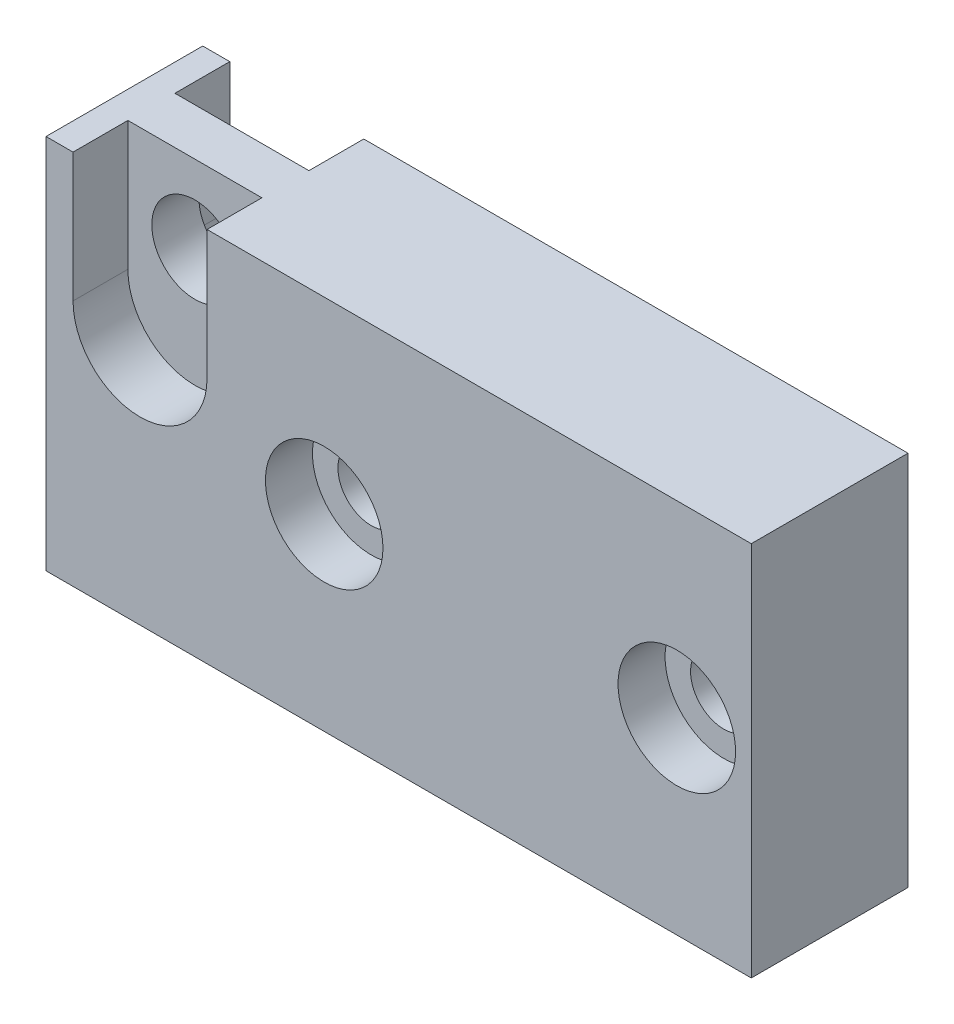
from build123d import *

# Parameters (mm, degrees)
EXTRUSION1_DEPTH      = 10
EXTRUSION1_DEPTH_BACK = 10
SKETCH1_W             = 90
SKETCH1_H             = 48
SKETCH2_R             = 4.25
SKETCH2_R_2           = 5.5
EXTRUSION2_DEPTH      = 55.781383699
SKETCH3_R             = 7.5
SKETCH3_R_2           = 4.25
EXTRUSION3_DEPTH      = 6
SKETCH4_R             = 5.5
EXTRUSION4_DEPTH      = 7


with BuildPart() as part:
    # Sketch1 → Extrusion1 (new, two sides: drawn at the far end of the back side and taken through both)
    with BuildSketch(Plane.XY.offset(-EXTRUSION1_DEPTH_BACK)):
        Rectangle(SKETCH1_W, SKETCH1_H)
    extrude(amount=EXTRUSION1_DEPTH + EXTRUSION1_DEPTH_BACK)

    # Sketch2 → Extrusion2 (cut, through all)
    with BuildSketch(Plane.XY.offset(10)):
        with Locations((35.5, 0)):
            Circle(SKETCH2_R)
        with Locations((-9.5, 0)):
            Circle(SKETCH2_R)
        with Locations((-33, 14)):
            Circle(SKETCH2_R_2)
    extrude(amount=-EXTRUSION2_DEPTH, mode=Mode.SUBTRACT)

    # Sketch3 → Extrusion3 (cut)
    # profile 1 of 2: a face of its own
    with BuildSketch(Plane.XY.offset(10)):
        with Locations((35.5, 0)):
            Circle(SKETCH3_R)
        with Locations((35.5, 0)):
            Circle(SKETCH3_R_2, mode=Mode.SUBTRACT)
    # profile 2 of 2: a face of its own
    with BuildSketch(Plane.XY.offset(10)):
        with Locations((-9.5, 0)):
            Circle(SKETCH3_R)
        with Locations((-9.5, 0)):
            Circle(SKETCH3_R_2, mode=Mode.SUBTRACT)
    extrusion3 = extrude(amount=-EXTRUSION3_DEPTH, mode=Mode.SUBTRACT)

    # Sketch4 → Extrusion4 (cut)
    with BuildSketch(Plane.XY.offset(10)):
        with BuildLine():
            ThreePointArc((-41.55, 7.55), (-33, -1), (-24.45, 7.55))
            Line((-24.45, 7.55), (-24.45, 24))
            Line((-24.45, 24), (-41.55, 24))
            Line((-41.55, 24), (-41.55, 7.55))
        make_face()
        with Locations((-33, 14)):
            Circle(SKETCH4_R, mode=Mode.SUBTRACT)
    extrusion4 = extrude(amount=-EXTRUSION4_DEPTH, mode=Mode.SUBTRACT)

    # Mirror1: Extrusion3, Extrusion4 across plane
    add(extrusion3.mirror(Plane.XY), mode=Mode.SUBTRACT)
    add(extrusion4.mirror(Plane.XY), mode=Mode.SUBTRACT)


solid = part.part
